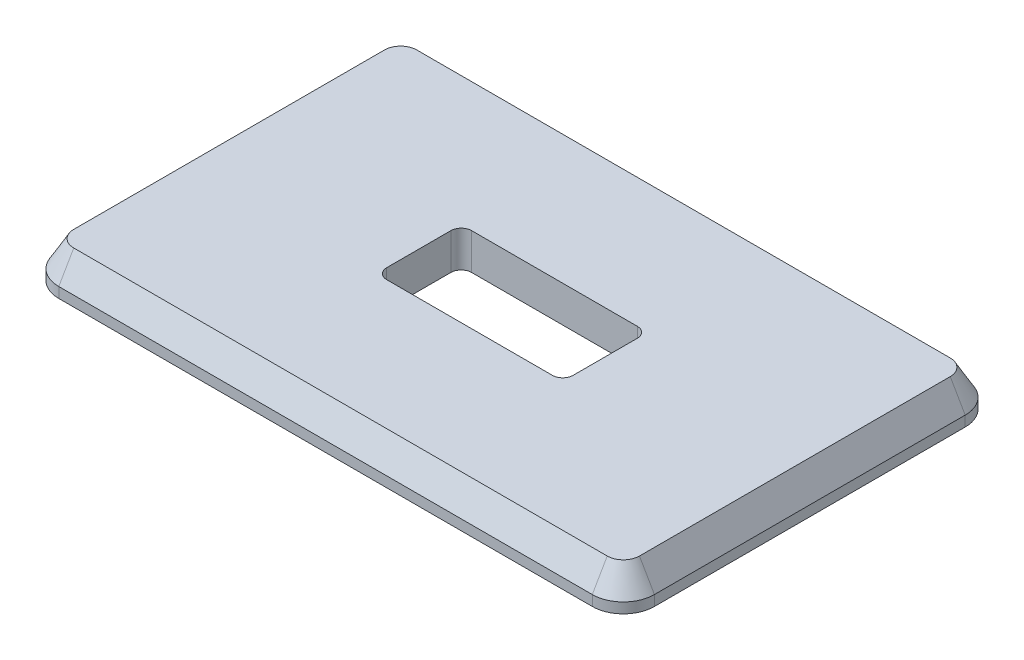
ISO-10303-21;
HEADER;
FILE_DESCRIPTION(('STEP AP214'),'2;1');
FILE_NAME('part.step','',(''),(''),'','','');
FILE_SCHEMA(('AUTOMOTIVE_DESIGN { 1 0 10303 214 1 1 1 1 }'));
ENDSEC;
DATA;
#1=APPLICATION_CONTEXT('core data for automotive mechanical design processes');
#2=APPLICATION_PROTOCOL_DEFINITION('international standard','automotive_design',2000,#1);
#3=PRODUCT_CONTEXT('',#1,'mechanical');
#4=PRODUCT('Part','Part','',(#3));
#5=PRODUCT_RELATED_PRODUCT_CATEGORY('part','',(#4));
#6=PRODUCT_DEFINITION_FORMATION('','',#4);
#7=PRODUCT_DEFINITION_CONTEXT('part definition',#1,'design');
#8=PRODUCT_DEFINITION('design','',#6,#7);
#9=PRODUCT_DEFINITION_SHAPE('','',#8);
#10=(LENGTH_UNIT() NAMED_UNIT(*) SI_UNIT(.MILLI.,.METRE.));
#11=(NAMED_UNIT(*) PLANE_ANGLE_UNIT() SI_UNIT($,.RADIAN.));
#12=(NAMED_UNIT(*) SI_UNIT($,.STERADIAN.) SOLID_ANGLE_UNIT());
#13=UNCERTAINTY_MEASURE_WITH_UNIT(LENGTH_MEASURE(1.E-05),#10,'distance_accuracy_value','');
#14=(GEOMETRIC_REPRESENTATION_CONTEXT(3) GLOBAL_UNCERTAINTY_ASSIGNED_CONTEXT((#13)) GLOBAL_UNIT_ASSIGNED_CONTEXT((#10,
#11,#12)) REPRESENTATION_CONTEXT('',''));
#15=CARTESIAN_POINT('',(0.,0.,0.));
#16=DIRECTION('',(0.,0.,1.));
#17=DIRECTION('',(1.,0.,0.));
#18=AXIS2_PLACEMENT_3D('',#15,#16,#17);
#19=CARTESIAN_POINT('',(-51.5,2.,-30.));
#20=DIRECTION('',(0.,-1.,0.));
#21=DIRECTION('',(0.,0.,-1.));
#22=AXIS2_PLACEMENT_3D('',#19,#20,#21);
#23=CYLINDRICAL_SURFACE('',#22,5.99999999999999);
#24=CARTESIAN_POINT('',(-51.5,0.,-30.));
#25=DIRECTION('',(0.,1.,0.));
#26=DIRECTION('',(0.,0.,-1.));
#27=AXIS2_PLACEMENT_3D('',#24,#25,#26);
#28=CIRCLE('',#27,5.99999999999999);
#29=CARTESIAN_POINT('',(-51.5,0.,-36.));
#30=VERTEX_POINT('',#29);
#31=CARTESIAN_POINT('',(-57.5,0.,-30.));
#32=VERTEX_POINT('',#31);
#33=EDGE_CURVE('E224',#30,#32,#28,.T.);
#34=ORIENTED_EDGE('',*,*,#33,.T.);
#35=DIRECTION('',(0.,-1.,0.));
#36=VECTOR('',#35,1.);
#37=CARTESIAN_POINT('',(-57.5,2.,-30.));
#38=LINE('',#37,#36);
#39=CARTESIAN_POINT('',(-57.5,2.,-30.));
#40=VERTEX_POINT('',#39);
#41=EDGE_CURVE('E10',#40,#32,#38,.T.);
#42=ORIENTED_EDGE('',*,*,#41,.F.);
#43=CARTESIAN_POINT('',(-51.5,2.,-30.));
#44=DIRECTION('',(0.,1.,0.));
#45=DIRECTION('',(0.,0.,-1.));
#46=AXIS2_PLACEMENT_3D('',#43,#44,#45);
#47=CIRCLE('',#46,5.99999999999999);
#48=CARTESIAN_POINT('',(-51.5,2.,-36.));
#49=VERTEX_POINT('',#48);
#50=EDGE_CURVE('E278',#49,#40,#47,.T.);
#51=ORIENTED_EDGE('',*,*,#50,.F.);
#52=DIRECTION('',(0.,-1.,0.));
#53=VECTOR('',#52,1.);
#54=CARTESIAN_POINT('',(-51.5,2.,-36.));
#55=LINE('',#54,#53);
#56=EDGE_CURVE('E302',#49,#30,#55,.T.);
#57=ORIENTED_EDGE('',*,*,#56,.T.);
#58=EDGE_LOOP('',(#34,#42,#51,#57));
#59=FACE_BOUND('',#58,.T.);
#60=ADVANCED_FACE('F15',(#59),#23,.T.);
#61=CARTESIAN_POINT('',(-57.5,2.,30.));
#62=DIRECTION('',(1.,0.,0.));
#63=DIRECTION('',(0.,0.,-1.));
#64=AXIS2_PLACEMENT_3D('',#61,#62,#63);
#65=PLANE('',#64);
#66=DIRECTION('',(0.,0.,1.));
#67=VECTOR('',#66,1.);
#68=CARTESIAN_POINT('',(-57.5,0.,30.));
#69=LINE('',#68,#67);
#70=CARTESIAN_POINT('',(-57.5,0.,30.));
#71=VERTEX_POINT('',#70);
#72=EDGE_CURVE('E264',#32,#71,#69,.T.);
#73=ORIENTED_EDGE('',*,*,#72,.T.);
#74=DIRECTION('',(0.,-1.,0.));
#75=VECTOR('',#74,1.);
#76=CARTESIAN_POINT('',(-57.5,2.,30.));
#77=LINE('',#76,#75);
#78=CARTESIAN_POINT('',(-57.5,2.,30.));
#79=VERTEX_POINT('',#78);
#80=EDGE_CURVE('E22',#79,#71,#77,.T.);
#81=ORIENTED_EDGE('',*,*,#80,.F.);
#82=DIRECTION('',(0.,0.,1.));
#83=VECTOR('',#82,1.);
#84=CARTESIAN_POINT('',(-57.5,2.,30.));
#85=LINE('',#84,#83);
#86=EDGE_CURVE('E281',#40,#79,#85,.T.);
#87=ORIENTED_EDGE('',*,*,#86,.F.);
#88=ORIENTED_EDGE('',*,*,#41,.T.);
#89=EDGE_LOOP('',(#73,#81,#87,#88));
#90=FACE_BOUND('',#89,.T.);
#91=ADVANCED_FACE('F357',(#90),#65,.F.);
#92=CARTESIAN_POINT('',(-51.5,2.,30.));
#93=DIRECTION('',(0.,-1.,0.));
#94=DIRECTION('',(0.,0.,-1.));
#95=AXIS2_PLACEMENT_3D('',#92,#93,#94);
#96=CYLINDRICAL_SURFACE('',#95,6.00000000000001);
#97=CARTESIAN_POINT('',(-51.5,0.,30.));
#98=DIRECTION('',(0.,1.,0.));
#99=DIRECTION('',(0.,0.,-1.));
#100=AXIS2_PLACEMENT_3D('',#97,#98,#99);
#101=CIRCLE('',#100,6.00000000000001);
#102=CARTESIAN_POINT('',(-51.5,0.,36.));
#103=VERTEX_POINT('',#102);
#104=EDGE_CURVE('E266',#71,#103,#101,.T.);
#105=ORIENTED_EDGE('',*,*,#104,.T.);
#106=DIRECTION('',(0.,-1.,0.));
#107=VECTOR('',#106,1.);
#108=CARTESIAN_POINT('',(-51.5,2.,36.));
#109=LINE('',#108,#107);
#110=CARTESIAN_POINT('',(-51.5,2.,36.));
#111=VERTEX_POINT('',#110);
#112=EDGE_CURVE('E317',#111,#103,#109,.T.);
#113=ORIENTED_EDGE('',*,*,#112,.F.);
#114=CARTESIAN_POINT('',(-51.5,2.,30.));
#115=DIRECTION('',(0.,1.,0.));
#116=DIRECTION('',(0.,0.,-1.));
#117=AXIS2_PLACEMENT_3D('',#114,#115,#116);
#118=CIRCLE('',#117,6.00000000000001);
#119=EDGE_CURVE('E284',#79,#111,#118,.T.);
#120=ORIENTED_EDGE('',*,*,#119,.F.);
#121=ORIENTED_EDGE('',*,*,#80,.T.);
#122=EDGE_LOOP('',(#105,#113,#120,#121));
#123=FACE_BOUND('',#122,.T.);
#124=ADVANCED_FACE('F323',(#123),#96,.T.);
#125=CARTESIAN_POINT('',(-51.5,2.,36.));
#126=DIRECTION('',(0.,0.,-1.));
#127=DIRECTION('',(-1.,0.,0.));
#128=AXIS2_PLACEMENT_3D('',#125,#126,#127);
#129=PLANE('',#128);
#130=DIRECTION('',(1.,0.,0.));
#131=VECTOR('',#130,1.);
#132=CARTESIAN_POINT('',(-51.5,0.,36.));
#133=LINE('',#132,#131);
#134=CARTESIAN_POINT('',(51.5,0.,36.));
#135=VERTEX_POINT('',#134);
#136=EDGE_CURVE('E268',#103,#135,#133,.T.);
#137=ORIENTED_EDGE('',*,*,#136,.T.);
#138=DIRECTION('',(0.,-1.,0.));
#139=VECTOR('',#138,1.);
#140=CARTESIAN_POINT('',(51.5,2.,36.));
#141=LINE('',#140,#139);
#142=CARTESIAN_POINT('',(51.5,2.,36.));
#143=VERTEX_POINT('',#142);
#144=EDGE_CURVE('E314',#143,#135,#141,.T.);
#145=ORIENTED_EDGE('',*,*,#144,.F.);
#146=DIRECTION('',(1.,0.,0.));
#147=VECTOR('',#146,1.);
#148=CARTESIAN_POINT('',(-51.5,2.,36.));
#149=LINE('',#148,#147);
#150=EDGE_CURVE('E287',#111,#143,#149,.T.);
#151=ORIENTED_EDGE('',*,*,#150,.F.);
#152=ORIENTED_EDGE('',*,*,#112,.T.);
#153=EDGE_LOOP('',(#137,#145,#151,#152));
#154=FACE_BOUND('',#153,.T.);
#155=ADVANCED_FACE('F332',(#154),#129,.F.);
#156=CARTESIAN_POINT('',(51.5,2.,30.));
#157=DIRECTION('',(0.,-1.,0.));
#158=DIRECTION('',(0.,0.,-1.));
#159=AXIS2_PLACEMENT_3D('',#156,#157,#158);
#160=CYLINDRICAL_SURFACE('',#159,5.99999999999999);
#161=CARTESIAN_POINT('',(51.5,0.,30.));
#162=DIRECTION('',(0.,1.,0.));
#163=DIRECTION('',(0.,0.,1.));
#164=AXIS2_PLACEMENT_3D('',#161,#162,#163);
#165=CIRCLE('',#164,5.99999999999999);
#166=CARTESIAN_POINT('',(57.5,0.,30.));
#167=VERTEX_POINT('',#166);
#168=EDGE_CURVE('E270',#135,#167,#165,.T.);
#169=ORIENTED_EDGE('',*,*,#168,.T.);
#170=DIRECTION('',(0.,-1.,0.));
#171=VECTOR('',#170,1.);
#172=CARTESIAN_POINT('',(57.5,2.,30.));
#173=LINE('',#172,#171);
#174=CARTESIAN_POINT('',(57.5,2.,30.));
#175=VERTEX_POINT('',#174);
#176=EDGE_CURVE('E311',#175,#167,#173,.T.);
#177=ORIENTED_EDGE('',*,*,#176,.F.);
#178=CARTESIAN_POINT('',(51.5,2.,30.));
#179=DIRECTION('',(0.,1.,0.));
#180=DIRECTION('',(0.,0.,1.));
#181=AXIS2_PLACEMENT_3D('',#178,#179,#180);
#182=CIRCLE('',#181,5.99999999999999);
#183=EDGE_CURVE('E290',#143,#175,#182,.T.);
#184=ORIENTED_EDGE('',*,*,#183,.F.);
#185=ORIENTED_EDGE('',*,*,#144,.T.);
#186=EDGE_LOOP('',(#169,#177,#184,#185));
#187=FACE_BOUND('',#186,.T.);
#188=ADVANCED_FACE('F336',(#187),#160,.T.);
#189=CARTESIAN_POINT('',(57.5,2.,30.));
#190=DIRECTION('',(-1.,0.,0.));
#191=DIRECTION('',(0.,0.,1.));
#192=AXIS2_PLACEMENT_3D('',#189,#190,#191);
#193=PLANE('',#192);
#194=DIRECTION('',(0.,0.,-1.));
#195=VECTOR('',#194,1.);
#196=CARTESIAN_POINT('',(57.5,0.,30.));
#197=LINE('',#196,#195);
#198=CARTESIAN_POINT('',(57.5,0.,-30.));
#199=VERTEX_POINT('',#198);
#200=EDGE_CURVE('E272',#167,#199,#197,.T.);
#201=ORIENTED_EDGE('',*,*,#200,.T.);
#202=DIRECTION('',(0.,-1.,0.));
#203=VECTOR('',#202,1.);
#204=CARTESIAN_POINT('',(57.5,2.,-30.));
#205=LINE('',#204,#203);
#206=CARTESIAN_POINT('',(57.5,2.,-30.));
#207=VERTEX_POINT('',#206);
#208=EDGE_CURVE('E308',#207,#199,#205,.T.);
#209=ORIENTED_EDGE('',*,*,#208,.F.);
#210=DIRECTION('',(0.,0.,-1.));
#211=VECTOR('',#210,1.);
#212=CARTESIAN_POINT('',(57.5,2.,30.));
#213=LINE('',#212,#211);
#214=EDGE_CURVE('E293',#175,#207,#213,.T.);
#215=ORIENTED_EDGE('',*,*,#214,.F.);
#216=ORIENTED_EDGE('',*,*,#176,.T.);
#217=EDGE_LOOP('',(#201,#209,#215,#216));
#218=FACE_BOUND('',#217,.T.);
#219=ADVANCED_FACE('F369',(#218),#193,.F.);
#220=CARTESIAN_POINT('',(51.5,2.,-30.));
#221=DIRECTION('',(0.,-1.,0.));
#222=DIRECTION('',(0.,0.,-1.));
#223=AXIS2_PLACEMENT_3D('',#220,#221,#222);
#224=CYLINDRICAL_SURFACE('',#223,5.99999999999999);
#225=CARTESIAN_POINT('',(51.5,0.,-30.));
#226=DIRECTION('',(0.,1.,0.));
#227=DIRECTION('',(0.,0.,-1.));
#228=AXIS2_PLACEMENT_3D('',#225,#226,#227);
#229=CIRCLE('',#228,5.99999999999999);
#230=CARTESIAN_POINT('',(51.5,0.,-36.));
#231=VERTEX_POINT('',#230);
#232=EDGE_CURVE('E274',#199,#231,#229,.T.);
#233=ORIENTED_EDGE('',*,*,#232,.T.);
#234=DIRECTION('',(0.,-1.,0.));
#235=VECTOR('',#234,1.);
#236=CARTESIAN_POINT('',(51.5,2.,-36.));
#237=LINE('',#236,#235);
#238=CARTESIAN_POINT('',(51.5,2.,-36.));
#239=VERTEX_POINT('',#238);
#240=EDGE_CURVE('E305',#239,#231,#237,.T.);
#241=ORIENTED_EDGE('',*,*,#240,.F.);
#242=CARTESIAN_POINT('',(51.5,2.,-30.));
#243=DIRECTION('',(0.,1.,0.));
#244=DIRECTION('',(0.,0.,-1.));
#245=AXIS2_PLACEMENT_3D('',#242,#243,#244);
#246=CIRCLE('',#245,5.99999999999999);
#247=EDGE_CURVE('E296',#207,#239,#246,.T.);
#248=ORIENTED_EDGE('',*,*,#247,.F.);
#249=ORIENTED_EDGE('',*,*,#208,.T.);
#250=EDGE_LOOP('',(#233,#241,#248,#249));
#251=FACE_BOUND('',#250,.T.);
#252=ADVANCED_FACE('F367',(#251),#224,.T.);
#253=CARTESIAN_POINT('',(-51.5,2.,-36.));
#254=DIRECTION('',(0.,0.,1.));
#255=DIRECTION('',(1.,0.,0.));
#256=AXIS2_PLACEMENT_3D('',#253,#254,#255);
#257=PLANE('',#256);
#258=DIRECTION('',(-1.,0.,0.));
#259=VECTOR('',#258,1.);
#260=CARTESIAN_POINT('',(-51.5,0.,-36.));
#261=LINE('',#260,#259);
#262=EDGE_CURVE('E276',#231,#30,#261,.T.);
#263=ORIENTED_EDGE('',*,*,#262,.T.);
#264=ORIENTED_EDGE('',*,*,#56,.F.);
#265=DIRECTION('',(-1.,0.,0.));
#266=VECTOR('',#265,1.);
#267=CARTESIAN_POINT('',(-51.5,2.,-36.));
#268=LINE('',#267,#266);
#269=EDGE_CURVE('E299',#239,#49,#268,.T.);
#270=ORIENTED_EDGE('',*,*,#269,.F.);
#271=ORIENTED_EDGE('',*,*,#240,.T.);
#272=EDGE_LOOP('',(#263,#264,#270,#271));
#273=FACE_BOUND('',#272,.T.);
#274=ADVANCED_FACE('F363',(#273),#257,.F.);
#275=CARTESIAN_POINT('',(-51.5,0.,-30.));
#276=DIRECTION('',(0.,-1.,0.));
#277=DIRECTION('',(0.,0.,-1.));
#278=AXIS2_PLACEMENT_3D('',#275,#276,#277);
#279=PLANE('',#278);
#280=CARTESIAN_POINT('',(16.,0.,-6.2));
#281=DIRECTION('',(0.,1.,0.));
#282=DIRECTION('',(0.,0.,-1.));
#283=AXIS2_PLACEMENT_3D('',#280,#281,#282);
#284=CIRCLE('',#283,2.);
#285=CARTESIAN_POINT('',(18.,0.,-6.2));
#286=VERTEX_POINT('',#285);
#287=CARTESIAN_POINT('',(16.,0.,-8.2));
#288=VERTEX_POINT('',#287);
#289=EDGE_CURVE('E187',#286,#288,#284,.T.);
#290=ORIENTED_EDGE('',*,*,#289,.T.);
#291=DIRECTION('',(-1.,0.,0.));
#292=VECTOR('',#291,1.);
#293=CARTESIAN_POINT('',(16.,0.,-8.2));
#294=LINE('',#293,#292);
#295=CARTESIAN_POINT('',(-16.,0.,-8.19999999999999));
#296=VERTEX_POINT('',#295);
#297=EDGE_CURVE('E190',#288,#296,#294,.T.);
#298=ORIENTED_EDGE('',*,*,#297,.T.);
#299=CARTESIAN_POINT('',(-16.,0.,-6.2));
#300=DIRECTION('',(0.,1.,0.));
#301=DIRECTION('',(0.,0.,1.));
#302=AXIS2_PLACEMENT_3D('',#299,#300,#301);
#303=CIRCLE('',#302,1.99999999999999);
#304=CARTESIAN_POINT('',(-18.,0.,-6.2));
#305=VERTEX_POINT('',#304);
#306=EDGE_CURVE('E29',#296,#305,#303,.T.);
#307=ORIENTED_EDGE('',*,*,#306,.T.);
#308=DIRECTION('',(0.,0.,1.));
#309=VECTOR('',#308,1.);
#310=CARTESIAN_POINT('',(-18.,0.,-6.2));
#311=LINE('',#310,#309);
#312=CARTESIAN_POINT('',(-18.,0.,6.20000000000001));
#313=VERTEX_POINT('',#312);
#314=EDGE_CURVE('E193',#305,#313,#311,.T.);
#315=ORIENTED_EDGE('',*,*,#314,.T.);
#316=CARTESIAN_POINT('',(-16.,0.,6.2));
#317=DIRECTION('',(0.,1.,0.));
#318=DIRECTION('',(0.,0.,-1.));
#319=AXIS2_PLACEMENT_3D('',#316,#317,#318);
#320=CIRCLE('',#319,1.99999999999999);
#321=CARTESIAN_POINT('',(-16.,0.,8.19999999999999));
#322=VERTEX_POINT('',#321);
#323=EDGE_CURVE('E196',#313,#322,#320,.T.);
#324=ORIENTED_EDGE('',*,*,#323,.T.);
#325=DIRECTION('',(1.,0.,0.));
#326=VECTOR('',#325,1.);
#327=CARTESIAN_POINT('',(16.,0.,8.19999999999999));
#328=LINE('',#327,#326);
#329=CARTESIAN_POINT('',(16.,0.,8.19999999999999));
#330=VERTEX_POINT('',#329);
#331=EDGE_CURVE('E199',#322,#330,#328,.T.);
#332=ORIENTED_EDGE('',*,*,#331,.T.);
#333=CARTESIAN_POINT('',(16.,0.,6.2));
#334=DIRECTION('',(0.,1.,0.));
#335=DIRECTION('',(0.,0.,-1.));
#336=AXIS2_PLACEMENT_3D('',#333,#334,#335);
#337=CIRCLE('',#336,1.99999999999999);
#338=CARTESIAN_POINT('',(18.,0.,6.20000000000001));
#339=VERTEX_POINT('',#338);
#340=EDGE_CURVE('E202',#330,#339,#337,.T.);
#341=ORIENTED_EDGE('',*,*,#340,.T.);
#342=DIRECTION('',(0.,0.,-1.));
#343=VECTOR('',#342,1.);
#344=CARTESIAN_POINT('',(18.,0.,-6.2));
#345=LINE('',#344,#343);
#346=EDGE_CURVE('E205',#339,#286,#345,.T.);
#347=ORIENTED_EDGE('',*,*,#346,.T.);
#348=EDGE_LOOP('',(#290,#298,#307,#315,#324,#332,#341,#347));
#349=FACE_BOUND('',#348,.T.);
#350=ORIENTED_EDGE('',*,*,#33,.F.);
#351=ORIENTED_EDGE('',*,*,#262,.F.);
#352=ORIENTED_EDGE('',*,*,#232,.F.);
#353=ORIENTED_EDGE('',*,*,#200,.F.);
#354=ORIENTED_EDGE('',*,*,#168,.F.);
#355=ORIENTED_EDGE('',*,*,#136,.F.);
#356=ORIENTED_EDGE('',*,*,#104,.F.);
#357=ORIENTED_EDGE('',*,*,#72,.F.);
#358=EDGE_LOOP('',(#350,#351,#352,#353,#354,#355,#356,#357));
#359=FACE_BOUND('',#358,.T.);
#360=ADVANCED_FACE('F328',(#349,#359),#279,.T.);
#361=CARTESIAN_POINT('',(-51.5,2.,-30.));
#362=DIRECTION('',(0.,-1.,0.));
#363=DIRECTION('',(0.,0.,1.));
#364=AXIS2_PLACEMENT_3D('',#361,#362,#363);
#365=CONICAL_SURFACE('',#364,5.99999999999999,0.5235987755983);
#366=ORIENTED_EDGE('',*,*,#50,.T.);
#367=DIRECTION('',(-0.500000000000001,-0.866025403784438,0.));
#368=VECTOR('',#367,1.);
#369=CARTESIAN_POINT('',(-57.5,2.,-30.));
#370=LINE('',#369,#368);
#371=CARTESIAN_POINT('',(-54.6132486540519,7.,-30.));
#372=VERTEX_POINT('',#371);
#373=EDGE_CURVE('E221',#372,#40,#370,.T.);
#374=ORIENTED_EDGE('',*,*,#373,.F.);
#375=CARTESIAN_POINT('',(-51.5,7.,-30.));
#376=DIRECTION('',(0.,1.,0.));
#377=DIRECTION('',(0.,0.,1.));
#378=AXIS2_PLACEMENT_3D('',#375,#376,#377);
#379=CIRCLE('',#378,3.11324865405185);
#380=CARTESIAN_POINT('',(-51.5,7.,-33.1132486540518));
#381=VERTEX_POINT('',#380);
#382=EDGE_CURVE('E210',#381,#372,#379,.T.);
#383=ORIENTED_EDGE('',*,*,#382,.F.);
#384=DIRECTION('',(0.,-0.866025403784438,-0.500000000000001));
#385=VECTOR('',#384,1.);
#386=CARTESIAN_POINT('',(-51.5,2.,-36.));
#387=LINE('',#386,#385);
#388=EDGE_CURVE('E226',#381,#49,#387,.T.);
#389=ORIENTED_EDGE('',*,*,#388,.T.);
#390=EDGE_LOOP('',(#366,#374,#383,#389));
#391=FACE_BOUND('',#390,.T.);
#392=ADVANCED_FACE('F382',(#391),#365,.T.);
#393=CARTESIAN_POINT('',(-57.5,2.,-30.));
#394=DIRECTION('',(-0.866025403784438,0.500000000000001,0.));
#395=DIRECTION('',(-0.500000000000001,-0.866025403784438,0.));
#396=AXIS2_PLACEMENT_3D('',#393,#394,#395);
#397=PLANE('',#396);
#398=ORIENTED_EDGE('',*,*,#86,.T.);
#399=DIRECTION('',(-0.500000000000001,-0.866025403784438,0.));
#400=VECTOR('',#399,1.);
#401=CARTESIAN_POINT('',(-57.5,2.,30.));
#402=LINE('',#401,#400);
#403=CARTESIAN_POINT('',(-54.6132486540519,7.,30.));
#404=VERTEX_POINT('',#403);
#405=EDGE_CURVE('E225',#404,#79,#402,.T.);
#406=ORIENTED_EDGE('',*,*,#405,.F.);
#407=DIRECTION('',(0.,0.,-1.));
#408=VECTOR('',#407,1.);
#409=CARTESIAN_POINT('',(-54.6132486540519,7.,-30.));
#410=LINE('',#409,#408);
#411=EDGE_CURVE('E249',#372,#404,#410,.F.);
#412=ORIENTED_EDGE('',*,*,#411,.F.);
#413=ORIENTED_EDGE('',*,*,#373,.T.);
#414=EDGE_LOOP('',(#398,#406,#412,#413));
#415=FACE_BOUND('',#414,.T.);
#416=ADVANCED_FACE('F354',(#415),#397,.T.);
#417=CARTESIAN_POINT('',(-51.5,2.,30.));
#418=DIRECTION('',(0.,-1.,0.));
#419=DIRECTION('',(0.,0.,1.));
#420=AXIS2_PLACEMENT_3D('',#417,#418,#419);
#421=CONICAL_SURFACE('',#420,6.00000000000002,0.5235987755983);
#422=ORIENTED_EDGE('',*,*,#119,.T.);
#423=DIRECTION('',(0.,-0.866025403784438,0.500000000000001));
#424=VECTOR('',#423,1.);
#425=CARTESIAN_POINT('',(-51.5,2.,36.));
#426=LINE('',#425,#424);
#427=CARTESIAN_POINT('',(-51.5,7.,33.1132486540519));
#428=VERTEX_POINT('',#427);
#429=EDGE_CURVE('E242',#428,#111,#426,.T.);
#430=ORIENTED_EDGE('',*,*,#429,.F.);
#431=CARTESIAN_POINT('',(-51.5,7.,30.));
#432=DIRECTION('',(0.,1.,0.));
#433=DIRECTION('',(0.,0.,1.));
#434=AXIS2_PLACEMENT_3D('',#431,#432,#433);
#435=CIRCLE('',#434,3.11324865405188);
#436=EDGE_CURVE('E251',#404,#428,#435,.T.);
#437=ORIENTED_EDGE('',*,*,#436,.F.);
#438=ORIENTED_EDGE('',*,*,#405,.T.);
#439=EDGE_LOOP('',(#422,#430,#437,#438));
#440=FACE_BOUND('',#439,.T.);
#441=ADVANCED_FACE('F352',(#440),#421,.T.);
#442=CARTESIAN_POINT('',(-51.5,2.,36.));
#443=DIRECTION('',(0.,0.500000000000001,0.866025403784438));
#444=DIRECTION('',(0.,-0.866025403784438,0.500000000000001));
#445=AXIS2_PLACEMENT_3D('',#442,#443,#444);
#446=PLANE('',#445);
#447=ORIENTED_EDGE('',*,*,#150,.T.);
#448=DIRECTION('',(0.,-0.866025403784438,0.500000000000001));
#449=VECTOR('',#448,1.);
#450=CARTESIAN_POINT('',(51.5,2.,36.));
#451=LINE('',#450,#449);
#452=CARTESIAN_POINT('',(51.5,7.,33.1132486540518));
#453=VERTEX_POINT('',#452);
#454=EDGE_CURVE('E239',#453,#143,#451,.T.);
#455=ORIENTED_EDGE('',*,*,#454,.F.);
#456=DIRECTION('',(-1.,0.,0.));
#457=VECTOR('',#456,1.);
#458=CARTESIAN_POINT('',(-51.5,7.,33.1132486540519));
#459=LINE('',#458,#457);
#460=EDGE_CURVE('E253',#428,#453,#459,.F.);
#461=ORIENTED_EDGE('',*,*,#460,.F.);
#462=ORIENTED_EDGE('',*,*,#429,.T.);
#463=EDGE_LOOP('',(#447,#455,#461,#462));
#464=FACE_BOUND('',#463,.T.);
#465=ADVANCED_FACE('F342',(#464),#446,.T.);
#466=CARTESIAN_POINT('',(51.5,2.,30.));
#467=DIRECTION('',(0.,-1.,0.));
#468=DIRECTION('',(0.,0.,1.));
#469=AXIS2_PLACEMENT_3D('',#466,#467,#468);
#470=CONICAL_SURFACE('',#469,5.99999999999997,0.5235987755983);
#471=ORIENTED_EDGE('',*,*,#183,.T.);
#472=DIRECTION('',(0.500000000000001,-0.866025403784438,0.));
#473=VECTOR('',#472,1.);
#474=CARTESIAN_POINT('',(57.5,2.,30.));
#475=LINE('',#474,#473);
#476=CARTESIAN_POINT('',(54.6132486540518,7.,30.));
#477=VERTEX_POINT('',#476);
#478=EDGE_CURVE('E236',#477,#175,#475,.T.);
#479=ORIENTED_EDGE('',*,*,#478,.F.);
#480=CARTESIAN_POINT('',(51.5,7.,30.));
#481=DIRECTION('',(0.,1.,0.));
#482=DIRECTION('',(0.,0.,1.));
#483=AXIS2_PLACEMENT_3D('',#480,#481,#482);
#484=CIRCLE('',#483,3.11324865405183);
#485=EDGE_CURVE('E255',#453,#477,#484,.T.);
#486=ORIENTED_EDGE('',*,*,#485,.F.);
#487=ORIENTED_EDGE('',*,*,#454,.T.);
#488=EDGE_LOOP('',(#471,#479,#486,#487));
#489=FACE_BOUND('',#488,.T.);
#490=ADVANCED_FACE('F346',(#489),#470,.T.);
#491=CARTESIAN_POINT('',(57.5,2.,30.));
#492=DIRECTION('',(0.866025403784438,0.500000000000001,0.));
#493=DIRECTION('',(-0.500000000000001,0.866025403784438,0.));
#494=AXIS2_PLACEMENT_3D('',#491,#492,#493);
#495=PLANE('',#494);
#496=ORIENTED_EDGE('',*,*,#214,.T.);
#497=DIRECTION('',(0.500000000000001,-0.866025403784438,0.));
#498=VECTOR('',#497,1.);
#499=CARTESIAN_POINT('',(57.5,2.,-30.));
#500=LINE('',#499,#498);
#501=CARTESIAN_POINT('',(54.6132486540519,7.,-30.));
#502=VERTEX_POINT('',#501);
#503=EDGE_CURVE('E233',#502,#207,#500,.T.);
#504=ORIENTED_EDGE('',*,*,#503,.F.);
#505=DIRECTION('',(0.,0.,1.));
#506=VECTOR('',#505,1.);
#507=CARTESIAN_POINT('',(54.6132486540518,7.,30.));
#508=LINE('',#507,#506);
#509=EDGE_CURVE('E257',#477,#502,#508,.F.);
#510=ORIENTED_EDGE('',*,*,#509,.F.);
#511=ORIENTED_EDGE('',*,*,#478,.T.);
#512=EDGE_LOOP('',(#496,#504,#510,#511));
#513=FACE_BOUND('',#512,.T.);
#514=ADVANCED_FACE('F371',(#513),#495,.T.);
#515=CARTESIAN_POINT('',(51.5,2.,-30.));
#516=DIRECTION('',(0.,-1.,0.));
#517=DIRECTION('',(0.,0.,1.));
#518=AXIS2_PLACEMENT_3D('',#515,#516,#517);
#519=CONICAL_SURFACE('',#518,5.99999999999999,0.5235987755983);
#520=ORIENTED_EDGE('',*,*,#247,.T.);
#521=DIRECTION('',(0.,-0.866025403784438,-0.500000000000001));
#522=VECTOR('',#521,1.);
#523=CARTESIAN_POINT('',(51.5,2.,-36.));
#524=LINE('',#523,#522);
#525=CARTESIAN_POINT('',(51.5,7.,-33.1132486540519));
#526=VERTEX_POINT('',#525);
#527=EDGE_CURVE('E229',#526,#239,#524,.T.);
#528=ORIENTED_EDGE('',*,*,#527,.F.);
#529=CARTESIAN_POINT('',(51.5,7.,-30.));
#530=DIRECTION('',(0.,1.,0.));
#531=DIRECTION('',(0.,0.,1.));
#532=AXIS2_PLACEMENT_3D('',#529,#530,#531);
#533=CIRCLE('',#532,3.11324865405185);
#534=EDGE_CURVE('E259',#502,#526,#533,.T.);
#535=ORIENTED_EDGE('',*,*,#534,.F.);
#536=ORIENTED_EDGE('',*,*,#503,.T.);
#537=EDGE_LOOP('',(#520,#528,#535,#536));
#538=FACE_BOUND('',#537,.T.);
#539=ADVANCED_FACE('F374',(#538),#519,.T.);
#540=CARTESIAN_POINT('',(51.5,2.,-36.));
#541=DIRECTION('',(0.,0.500000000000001,-0.866025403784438));
#542=DIRECTION('',(0.,0.866025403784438,0.500000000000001));
#543=AXIS2_PLACEMENT_3D('',#540,#541,#542);
#544=PLANE('',#543);
#545=ORIENTED_EDGE('',*,*,#269,.T.);
#546=ORIENTED_EDGE('',*,*,#388,.F.);
#547=DIRECTION('',(1.,0.,0.));
#548=VECTOR('',#547,1.);
#549=CARTESIAN_POINT('',(51.5,7.,-33.1132486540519));
#550=LINE('',#549,#548);
#551=EDGE_CURVE('E230',#526,#381,#550,.F.);
#552=ORIENTED_EDGE('',*,*,#551,.F.);
#553=ORIENTED_EDGE('',*,*,#527,.T.);
#554=EDGE_LOOP('',(#545,#546,#552,#553));
#555=FACE_BOUND('',#554,.T.);
#556=ADVANCED_FACE('F380',(#555),#544,.T.);
#557=CARTESIAN_POINT('',(-51.5,7.,-30.));
#558=DIRECTION('',(0.,1.,0.));
#559=DIRECTION('',(0.,0.,1.));
#560=AXIS2_PLACEMENT_3D('',#557,#558,#559);
#561=PLANE('',#560);
#562=CARTESIAN_POINT('',(16.,7.,-6.2));
#563=DIRECTION('',(0.,1.,0.));
#564=DIRECTION('',(0.,0.,-1.));
#565=AXIS2_PLACEMENT_3D('',#562,#563,#564);
#566=CIRCLE('',#565,2.);
#567=CARTESIAN_POINT('',(18.,7.,-6.2));
#568=VERTEX_POINT('',#567);
#569=CARTESIAN_POINT('',(16.,7.,-8.2));
#570=VERTEX_POINT('',#569);
#571=EDGE_CURVE('E37',#568,#570,#566,.T.);
#572=ORIENTED_EDGE('',*,*,#571,.F.);
#573=DIRECTION('',(0.,0.,-1.));
#574=VECTOR('',#573,1.);
#575=CARTESIAN_POINT('',(18.,7.,-6.2));
#576=LINE('',#575,#574);
#577=CARTESIAN_POINT('',(18.,7.,6.20000000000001));
#578=VERTEX_POINT('',#577);
#579=EDGE_CURVE('E184',#578,#568,#576,.T.);
#580=ORIENTED_EDGE('',*,*,#579,.F.);
#581=CARTESIAN_POINT('',(16.,7.,6.2));
#582=DIRECTION('',(0.,1.,0.));
#583=DIRECTION('',(0.,0.,-1.));
#584=AXIS2_PLACEMENT_3D('',#581,#582,#583);
#585=CIRCLE('',#584,1.99999999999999);
#586=CARTESIAN_POINT('',(16.,7.,8.19999999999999));
#587=VERTEX_POINT('',#586);
#588=EDGE_CURVE('E181',#587,#578,#585,.T.);
#589=ORIENTED_EDGE('',*,*,#588,.F.);
#590=DIRECTION('',(1.,0.,0.));
#591=VECTOR('',#590,1.);
#592=CARTESIAN_POINT('',(16.,7.,8.19999999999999));
#593=LINE('',#592,#591);
#594=CARTESIAN_POINT('',(-16.,7.,8.19999999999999));
#595=VERTEX_POINT('',#594);
#596=EDGE_CURVE('E178',#595,#587,#593,.T.);
#597=ORIENTED_EDGE('',*,*,#596,.F.);
#598=CARTESIAN_POINT('',(-16.,7.,6.2));
#599=DIRECTION('',(0.,1.,0.));
#600=DIRECTION('',(0.,0.,-1.));
#601=AXIS2_PLACEMENT_3D('',#598,#599,#600);
#602=CIRCLE('',#601,1.99999999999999);
#603=CARTESIAN_POINT('',(-18.,7.,6.20000000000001));
#604=VERTEX_POINT('',#603);
#605=EDGE_CURVE('E172',#604,#595,#602,.T.);
#606=ORIENTED_EDGE('',*,*,#605,.F.);
#607=DIRECTION('',(0.,0.,1.));
#608=VECTOR('',#607,1.);
#609=CARTESIAN_POINT('',(-18.,7.,-6.2));
#610=LINE('',#609,#608);
#611=CARTESIAN_POINT('',(-18.,7.,-6.2));
#612=VERTEX_POINT('',#611);
#613=EDGE_CURVE('E170',#612,#604,#610,.T.);
#614=ORIENTED_EDGE('',*,*,#613,.F.);
#615=CARTESIAN_POINT('',(-16.,7.,-6.2));
#616=DIRECTION('',(0.,1.,0.));
#617=DIRECTION('',(0.,0.,1.));
#618=AXIS2_PLACEMENT_3D('',#615,#616,#617);
#619=CIRCLE('',#618,1.99999999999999);
#620=CARTESIAN_POINT('',(-16.,7.,-8.19999999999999));
#621=VERTEX_POINT('',#620);
#622=EDGE_CURVE('E153',#621,#612,#619,.T.);
#623=ORIENTED_EDGE('',*,*,#622,.F.);
#624=DIRECTION('',(-1.,0.,0.));
#625=VECTOR('',#624,1.);
#626=CARTESIAN_POINT('',(16.,7.,-8.2));
#627=LINE('',#626,#625);
#628=EDGE_CURVE('E162',#570,#621,#627,.T.);
#629=ORIENTED_EDGE('',*,*,#628,.F.);
#630=EDGE_LOOP('',(#572,#580,#589,#597,#606,#614,#623,#629));
#631=FACE_BOUND('',#630,.T.);
#632=ORIENTED_EDGE('',*,*,#382,.T.);
#633=ORIENTED_EDGE('',*,*,#411,.T.);
#634=ORIENTED_EDGE('',*,*,#436,.T.);
#635=ORIENTED_EDGE('',*,*,#460,.T.);
#636=ORIENTED_EDGE('',*,*,#485,.T.);
#637=ORIENTED_EDGE('',*,*,#509,.T.);
#638=ORIENTED_EDGE('',*,*,#534,.T.);
#639=ORIENTED_EDGE('',*,*,#551,.T.);
#640=EDGE_LOOP('',(#632,#633,#634,#635,#636,#637,#638,#639));
#641=FACE_BOUND('',#640,.T.);
#642=ADVANCED_FACE('F166',(#631,#641),#561,.T.);
#643=CARTESIAN_POINT('',(16.,0.,-6.2));
#644=DIRECTION('',(0.,1.,0.));
#645=DIRECTION('',(0.,0.,1.));
#646=AXIS2_PLACEMENT_3D('',#643,#644,#645);
#647=CYLINDRICAL_SURFACE('',#646,2.);
#648=ORIENTED_EDGE('',*,*,#571,.T.);
#649=DIRECTION('',(0.,1.,0.));
#650=VECTOR('',#649,1.);
#651=CARTESIAN_POINT('',(16.,0.,-8.2));
#652=LINE('',#651,#650);
#653=EDGE_CURVE('E159',#288,#570,#652,.T.);
#654=ORIENTED_EDGE('',*,*,#653,.F.);
#655=ORIENTED_EDGE('',*,*,#289,.F.);
#656=DIRECTION('',(0.,1.,0.));
#657=VECTOR('',#656,1.);
#658=CARTESIAN_POINT('',(18.,0.,-6.2));
#659=LINE('',#658,#657);
#660=EDGE_CURVE('E208',#286,#568,#659,.T.);
#661=ORIENTED_EDGE('',*,*,#660,.T.);
#662=EDGE_LOOP('',(#648,#654,#655,#661));
#663=FACE_BOUND('',#662,.T.);
#664=ADVANCED_FACE('F431',(#663),#647,.F.);
#665=CARTESIAN_POINT('',(18.,0.,-6.2));
#666=DIRECTION('',(1.,0.,0.));
#667=DIRECTION('',(0.,0.,-1.));
#668=AXIS2_PLACEMENT_3D('',#665,#666,#667);
#669=PLANE('',#668);
#670=ORIENTED_EDGE('',*,*,#579,.T.);
#671=ORIENTED_EDGE('',*,*,#660,.F.);
#672=ORIENTED_EDGE('',*,*,#346,.F.);
#673=DIRECTION('',(0.,1.,0.));
#674=VECTOR('',#673,1.);
#675=CARTESIAN_POINT('',(18.,0.,6.20000000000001));
#676=LINE('',#675,#674);
#677=EDGE_CURVE('E211',#339,#578,#676,.T.);
#678=ORIENTED_EDGE('',*,*,#677,.T.);
#679=EDGE_LOOP('',(#670,#671,#672,#678));
#680=FACE_BOUND('',#679,.T.);
#681=ADVANCED_FACE('F436',(#680),#669,.F.);
#682=CARTESIAN_POINT('',(16.,0.,6.2));
#683=DIRECTION('',(0.,1.,0.));
#684=DIRECTION('',(0.,0.,1.));
#685=AXIS2_PLACEMENT_3D('',#682,#683,#684);
#686=CYLINDRICAL_SURFACE('',#685,1.99999999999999);
#687=ORIENTED_EDGE('',*,*,#588,.T.);
#688=ORIENTED_EDGE('',*,*,#677,.F.);
#689=ORIENTED_EDGE('',*,*,#340,.F.);
#690=DIRECTION('',(0.,1.,0.));
#691=VECTOR('',#690,1.);
#692=CARTESIAN_POINT('',(16.,0.,8.19999999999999));
#693=LINE('',#692,#691);
#694=EDGE_CURVE('E213',#330,#587,#693,.T.);
#695=ORIENTED_EDGE('',*,*,#694,.T.);
#696=EDGE_LOOP('',(#687,#688,#689,#695));
#697=FACE_BOUND('',#696,.T.);
#698=ADVANCED_FACE('F454',(#697),#686,.F.);
#699=CARTESIAN_POINT('',(16.,0.,8.19999999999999));
#700=DIRECTION('',(0.,0.,1.));
#701=DIRECTION('',(1.,0.,0.));
#702=AXIS2_PLACEMENT_3D('',#699,#700,#701);
#703=PLANE('',#702);
#704=ORIENTED_EDGE('',*,*,#596,.T.);
#705=ORIENTED_EDGE('',*,*,#694,.F.);
#706=ORIENTED_EDGE('',*,*,#331,.F.);
#707=DIRECTION('',(0.,1.,0.));
#708=VECTOR('',#707,1.);
#709=CARTESIAN_POINT('',(-16.,0.,8.19999999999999));
#710=LINE('',#709,#708);
#711=EDGE_CURVE('E215',#322,#595,#710,.T.);
#712=ORIENTED_EDGE('',*,*,#711,.T.);
#713=EDGE_LOOP('',(#704,#705,#706,#712));
#714=FACE_BOUND('',#713,.T.);
#715=ADVANCED_FACE('F450',(#714),#703,.F.);
#716=CARTESIAN_POINT('',(-16.,0.,6.2));
#717=DIRECTION('',(0.,1.,0.));
#718=DIRECTION('',(0.,0.,1.));
#719=AXIS2_PLACEMENT_3D('',#716,#717,#718);
#720=CYLINDRICAL_SURFACE('',#719,1.99999999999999);
#721=ORIENTED_EDGE('',*,*,#605,.T.);
#722=ORIENTED_EDGE('',*,*,#711,.F.);
#723=ORIENTED_EDGE('',*,*,#323,.F.);
#724=DIRECTION('',(0.,1.,0.));
#725=VECTOR('',#724,1.);
#726=CARTESIAN_POINT('',(-18.,0.,6.20000000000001));
#727=LINE('',#726,#725);
#728=EDGE_CURVE('E217',#313,#604,#727,.T.);
#729=ORIENTED_EDGE('',*,*,#728,.T.);
#730=EDGE_LOOP('',(#721,#722,#723,#729));
#731=FACE_BOUND('',#730,.T.);
#732=ADVANCED_FACE('F446',(#731),#720,.F.);
#733=CARTESIAN_POINT('',(-18.,0.,-6.2));
#734=DIRECTION('',(-1.,0.,0.));
#735=DIRECTION('',(0.,0.,1.));
#736=AXIS2_PLACEMENT_3D('',#733,#734,#735);
#737=PLANE('',#736);
#738=ORIENTED_EDGE('',*,*,#613,.T.);
#739=ORIENTED_EDGE('',*,*,#728,.F.);
#740=ORIENTED_EDGE('',*,*,#314,.F.);
#741=DIRECTION('',(0.,1.,0.));
#742=VECTOR('',#741,1.);
#743=CARTESIAN_POINT('',(-18.,0.,-6.2));
#744=LINE('',#743,#742);
#745=EDGE_CURVE('E158',#305,#612,#744,.T.);
#746=ORIENTED_EDGE('',*,*,#745,.T.);
#747=EDGE_LOOP('',(#738,#739,#740,#746));
#748=FACE_BOUND('',#747,.T.);
#749=ADVANCED_FACE('F443',(#748),#737,.F.);
#750=CARTESIAN_POINT('',(-16.,0.,-6.2));
#751=DIRECTION('',(0.,1.,0.));
#752=DIRECTION('',(0.,0.,1.));
#753=AXIS2_PLACEMENT_3D('',#750,#751,#752);
#754=CYLINDRICAL_SURFACE('',#753,1.99999999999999);
#755=ORIENTED_EDGE('',*,*,#622,.T.);
#756=ORIENTED_EDGE('',*,*,#745,.F.);
#757=ORIENTED_EDGE('',*,*,#306,.F.);
#758=DIRECTION('',(0.,1.,0.));
#759=VECTOR('',#758,1.);
#760=CARTESIAN_POINT('',(-16.,0.,-8.19999999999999));
#761=LINE('',#760,#759);
#762=EDGE_CURVE('E149',#296,#621,#761,.T.);
#763=ORIENTED_EDGE('',*,*,#762,.T.);
#764=EDGE_LOOP('',(#755,#756,#757,#763));
#765=FACE_BOUND('',#764,.T.);
#766=ADVANCED_FACE('F151',(#765),#754,.F.);
#767=CARTESIAN_POINT('',(16.,0.,-8.2));
#768=DIRECTION('',(0.,0.,-1.));
#769=DIRECTION('',(-1.,0.,0.));
#770=AXIS2_PLACEMENT_3D('',#767,#768,#769);
#771=PLANE('',#770);
#772=ORIENTED_EDGE('',*,*,#628,.T.);
#773=ORIENTED_EDGE('',*,*,#762,.F.);
#774=ORIENTED_EDGE('',*,*,#297,.F.);
#775=ORIENTED_EDGE('',*,*,#653,.T.);
#776=EDGE_LOOP('',(#772,#773,#774,#775));
#777=FACE_BOUND('',#776,.T.);
#778=ADVANCED_FACE('F163',(#777),#771,.F.);
#779=CLOSED_SHELL('',(#60,#91,#124,#155,#188,#219,#252,#274,#360,#392,#416,#441,#465,#490,#514,
#539,#556,#642,#664,#681,#698,#715,#732,#749,#766,#778));
#780=MANIFOLD_SOLID_BREP('B1',#779);
#781=ADVANCED_BREP_SHAPE_REPRESENTATION('',(#18,#780),#14);
#782=SHAPE_DEFINITION_REPRESENTATION(#9,#781);
ENDSEC;
END-ISO-10303-21;
